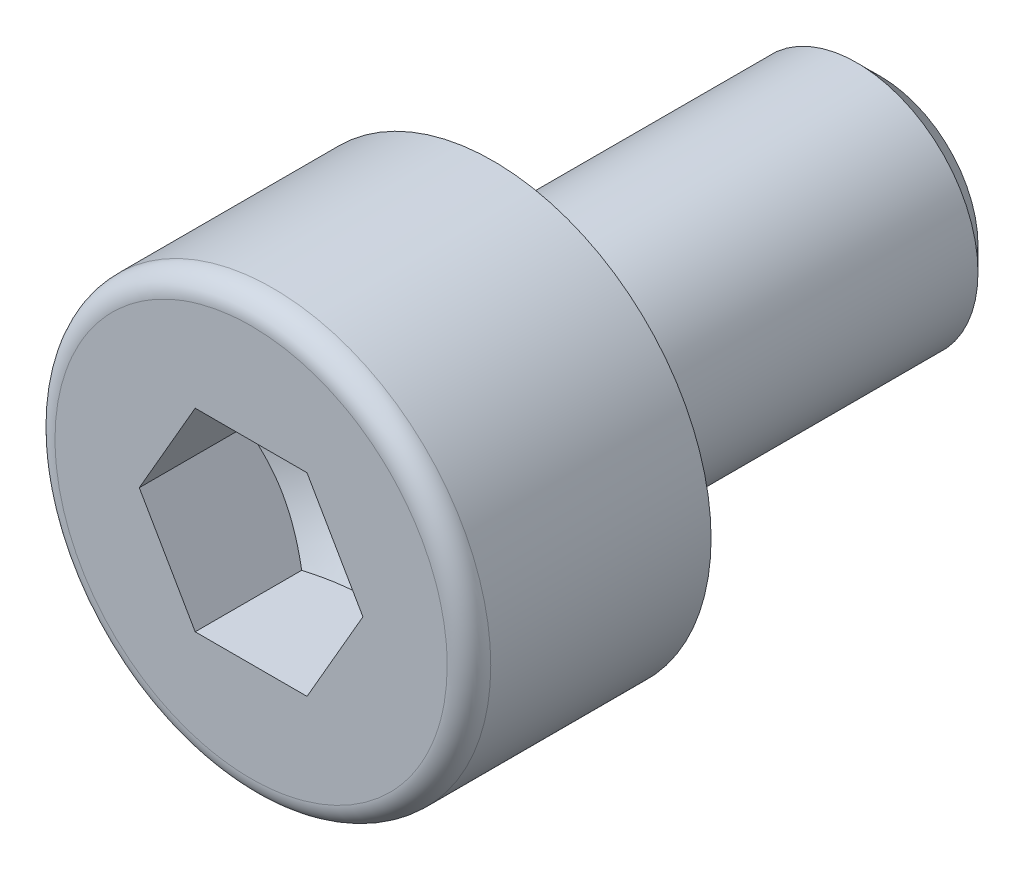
ISO-10303-21;
HEADER;
FILE_DESCRIPTION(('STEP AP214'),'2;1');
FILE_NAME('part.step','',(''),(''),'','','');
FILE_SCHEMA(('AUTOMOTIVE_DESIGN { 1 0 10303 214 1 1 1 1 }'));
ENDSEC;
DATA;
#1=APPLICATION_CONTEXT('core data for automotive mechanical design processes');
#2=APPLICATION_PROTOCOL_DEFINITION('international standard','automotive_design',2000,#1);
#3=PRODUCT_CONTEXT('',#1,'mechanical');
#4=PRODUCT('Part','Part','',(#3));
#5=PRODUCT_RELATED_PRODUCT_CATEGORY('part','',(#4));
#6=PRODUCT_DEFINITION_FORMATION('','',#4);
#7=PRODUCT_DEFINITION_CONTEXT('part definition',#1,'design');
#8=PRODUCT_DEFINITION('design','',#6,#7);
#9=PRODUCT_DEFINITION_SHAPE('','',#8);
#10=(LENGTH_UNIT() NAMED_UNIT(*) SI_UNIT(.MILLI.,.METRE.));
#11=(NAMED_UNIT(*) PLANE_ANGLE_UNIT() SI_UNIT($,.RADIAN.));
#12=(NAMED_UNIT(*) SI_UNIT($,.STERADIAN.) SOLID_ANGLE_UNIT());
#13=UNCERTAINTY_MEASURE_WITH_UNIT(LENGTH_MEASURE(1.E-05),#10,'distance_accuracy_value','');
#14=(GEOMETRIC_REPRESENTATION_CONTEXT(3) GLOBAL_UNCERTAINTY_ASSIGNED_CONTEXT((#13)) GLOBAL_UNIT_ASSIGNED_CONTEXT((#10,
#11,#12)) REPRESENTATION_CONTEXT('',''));
#15=CARTESIAN_POINT('',(0.,0.,0.));
#16=DIRECTION('',(0.,0.,1.));
#17=DIRECTION('',(1.,0.,0.));
#18=AXIS2_PLACEMENT_3D('',#15,#16,#17);
#19=CARTESIAN_POINT('',(0.,0.503218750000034,-4.00000000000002));
#20=DIRECTION('',(0.,0.,-1.));
#21=DIRECTION('',(-1.,0.,0.));
#22=AXIS2_PLACEMENT_3D('',#19,#20,#21);
#23=PLANE('',#22);
#24=CARTESIAN_POINT('',(0.,0.,-3.99999999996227));
#25=DIRECTION('',(0.,0.,1.));
#26=DIRECTION('',(0.,-1.,0.));
#27=AXIS2_PLACEMENT_3D('',#24,#25,#26);
#28=CIRCLE('',#27,1.00643749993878);
#29=CARTESIAN_POINT('',(0.,-1.00643749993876,-3.99999999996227));
#30=VERTEX_POINT('',#29);
#31=EDGE_CURVE('E22',#30,#30,#28,.T.);
#32=ORIENTED_EDGE('',*,*,#31,.F.);
#33=EDGE_LOOP('',(#32));
#34=FACE_BOUND('',#33,.T.);
#35=ADVANCED_FACE('F17',(#34),#23,.T.);
#36=CARTESIAN_POINT('',(0.,0.,-3.75643749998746));
#37=DIRECTION('',(0.,0.,1.));
#38=DIRECTION('',(0.,-1.,0.));
#39=AXIS2_PLACEMENT_3D('',#36,#37,#38);
#40=CONICAL_SURFACE('',#39,1.24999999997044,0.78539816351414);
#41=CARTESIAN_POINT('',(0.,0.,-3.7564375));
#42=DIRECTION('',(0.,0.,1.));
#43=DIRECTION('',(1.,0.,0.));
#44=AXIS2_PLACEMENT_3D('',#41,#42,#43);
#45=CIRCLE('',#44,1.25);
#46=CARTESIAN_POINT('',(1.24999999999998,0.,-3.7564375));
#47=VERTEX_POINT('',#46);
#48=EDGE_CURVE('E93',#47,#47,#45,.T.);
#49=ORIENTED_EDGE('',*,*,#48,.F.);
#50=EDGE_LOOP('',(#49));
#51=FACE_BOUND('',#50,.T.);
#52=ORIENTED_EDGE('',*,*,#31,.T.);
#53=EDGE_LOOP('',(#52));
#54=FACE_BOUND('',#53,.T.);
#55=ADVANCED_FACE('F83',(#51,#54),#40,.T.);
#56=CARTESIAN_POINT('',(0.,0.,1.40399999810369));
#57=DIRECTION('',(0.,0.,1.));
#58=DIRECTION('',(1.,0.,0.));
#59=AXIS2_PLACEMENT_3D('',#56,#57,#58);
#60=CONICAL_SURFACE('',#59,1.1616281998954,1.04719755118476);
#61=CARTESIAN_POINT('',(0.,0.,0.733333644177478));
#62=VERTEX_POINT('',#61);
#63=VERTEX_LOOP('',#62);
#64=FACE_BOUND('',#63,.T.);
#65=CARTESIAN_POINT('',(0.577350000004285,-0.999999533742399,1.4000000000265));
#66=CARTESIAN_POINT('',(0.602721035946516,-0.956055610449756,1.38534777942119));
#67=CARTESIAN_POINT('',(0.62831107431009,-0.911732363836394,1.37202235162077));
#68=CARTESIAN_POINT('',(0.679934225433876,-0.822318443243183,1.34876321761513));
#69=CARTESIAN_POINT('',(0.705968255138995,-0.777226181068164,1.33883773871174));
#70=CARTESIAN_POINT('',(0.757713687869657,-0.687600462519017,1.32338801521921));
#71=CARTESIAN_POINT('',(0.783417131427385,-0.643080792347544,1.31776093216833));
#72=CARTESIAN_POINT('',(0.834944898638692,-0.553832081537,1.31104462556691));
#73=CARTESIAN_POINT('',(0.860769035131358,-0.509103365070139,1.30994983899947));
#74=CARTESIAN_POINT('',(0.909018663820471,-0.425532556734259,1.31223318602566));
#75=CARTESIAN_POINT('',(0.931451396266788,-0.386677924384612,1.31505068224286));
#76=CARTESIAN_POINT('',(0.97617071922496,-0.309221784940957,1.32397868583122));
#77=CARTESIAN_POINT('',(0.998457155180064,-0.270620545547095,1.330092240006));
#78=CARTESIAN_POINT('',(1.04326860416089,-0.193004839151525,1.34537494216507));
#79=CARTESIAN_POINT('',(1.06578794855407,-0.154000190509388,1.35460884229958));
#80=CARTESIAN_POINT('',(1.11049085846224,-0.0765724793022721,1.37556589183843));
#81=CARTESIAN_POINT('',(1.13267499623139,-0.0381484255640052,1.38728412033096));
#82=CARTESIAN_POINT('',(1.15469999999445,-9.5062846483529E-12,1.40000000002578));
#83=B_SPLINE_CURVE_WITH_KNOTS('',3,(#65,#66,#67,#68,#69,#70,#71,#72,#73,#74,#75,#76,#77,#78,#79,
#80,#81,#82),.UNSPECIFIED.,.F.,.F.,(4,2,2,2,2,2,2,2,4),(0.,0.158507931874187,0.317396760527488,
0.47235358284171,0.627120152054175,0.761853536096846,0.896711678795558,1.03456032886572,
1.17213844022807),.UNSPECIFIED.);
#84=CARTESIAN_POINT('',(0.577349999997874,-0.999999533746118,1.4000000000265));
#85=VERTEX_POINT('',#84);
#86=CARTESIAN_POINT('',(1.15470000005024,0.,1.40000000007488));
#87=VERTEX_POINT('',#86);
#88=EDGE_CURVE('E75',#85,#87,#83,.T.);
#89=ORIENTED_EDGE('',*,*,#88,.T.);
#90=CARTESIAN_POINT('',(1.15469999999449,9.57567358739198E-12,1.40000000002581));
#91=CARTESIAN_POINT('',(1.12932896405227,0.0439439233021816,1.38534777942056));
#92=CARTESIAN_POINT('',(1.10373892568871,0.0882671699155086,1.3720223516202));
#93=CARTESIAN_POINT('',(1.05211577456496,0.17768109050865,1.34876321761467));
#94=CARTESIAN_POINT('',(1.02608174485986,0.222773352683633,1.33883773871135));
#95=CARTESIAN_POINT('',(0.974336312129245,0.312399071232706,1.32338801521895));
#96=CARTESIAN_POINT('',(0.948632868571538,0.35691874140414,1.31776093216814));
#97=CARTESIAN_POINT('',(0.89710510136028,0.446167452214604,1.31104462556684));
#98=CARTESIAN_POINT('',(0.871280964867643,0.490896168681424,1.30994983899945));
#99=CARTESIAN_POINT('',(0.823031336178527,0.574466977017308,1.31223318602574));
#100=CARTESIAN_POINT('',(0.800598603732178,0.613321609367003,1.315050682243));
#101=CARTESIAN_POINT('',(0.755879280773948,0.690777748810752,1.32397868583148));
#102=CARTESIAN_POINT('',(0.733592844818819,0.729378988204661,1.33009224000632));
#103=CARTESIAN_POINT('',(0.688781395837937,0.806994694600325,1.34537494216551));
#104=CARTESIAN_POINT('',(0.666262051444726,0.845999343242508,1.35460884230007));
#105=CARTESIAN_POINT('',(0.621559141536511,0.923427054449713,1.37556589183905));
#106=CARTESIAN_POINT('',(0.599375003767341,0.961851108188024,1.38728412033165));
#107=CARTESIAN_POINT('',(0.577350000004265,0.999999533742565,1.40000000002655));
#108=B_SPLINE_CURVE_WITH_KNOTS('',3,(#90,#91,#92,#93,#94,#95,#96,#97,#98,#99,#100,#101,#102,
#103,#104,#105,#106,#107),.UNSPECIFIED.,.F.,.F.,(4,2,2,2,2,2,2,2,4),(0.,0.15850793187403,
0.317396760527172,0.472353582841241,0.627120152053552,0.761853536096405,0.8967116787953,
1.03456032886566,1.17213844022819),.UNSPECIFIED.);
#109=CARTESIAN_POINT('',(0.577349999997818,0.999999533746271,1.40000000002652));
#110=VERTEX_POINT('',#109);
#111=EDGE_CURVE('E87',#87,#110,#108,.T.);
#112=ORIENTED_EDGE('',*,*,#111,.T.);
#113=CARTESIAN_POINT('',(0.577349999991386,0.999999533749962,1.40000000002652));
#114=CARTESIAN_POINT('',(0.526607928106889,0.999999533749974,1.38534777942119));
#115=CARTESIAN_POINT('',(0.475427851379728,0.999999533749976,1.37202235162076));
#116=CARTESIAN_POINT('',(0.372181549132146,0.999999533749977,1.34876321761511));
#117=CARTESIAN_POINT('',(0.320113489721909,0.999999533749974,1.33883773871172));
#118=CARTESIAN_POINT('',(0.216622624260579,0.999999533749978,1.3233880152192));
#119=CARTESIAN_POINT('',(0.165215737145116,0.999999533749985,1.31776093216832));
#120=CARTESIAN_POINT('',(0.0621602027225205,0.999999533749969,1.31104462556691));
#121=CARTESIAN_POINT('',(0.0105119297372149,0.999999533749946,1.30994983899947));
#122=CARTESIAN_POINT('',(-0.0859873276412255,0.99999953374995,1.31223318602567));
#123=CARTESIAN_POINT('',(-0.130852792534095,0.99999953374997,1.31505068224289));
#124=CARTESIAN_POINT('',(-0.220291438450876,0.999999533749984,1.32397868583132));
#125=CARTESIAN_POINT('',(-0.264864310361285,0.999999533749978,1.33009224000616));
#126=CARTESIAN_POINT('',(-0.354487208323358,0.999999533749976,1.34537494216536));
#127=CARTESIAN_POINT('',(-0.399525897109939,0.99999953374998,1.35460884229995));
#128=CARTESIAN_POINT('',(-0.488931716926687,0.999999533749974,1.37556589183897));
#129=CARTESIAN_POINT('',(-0.533299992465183,0.999999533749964,1.3872841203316));
#130=CARTESIAN_POINT('',(-0.57734999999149,0.999999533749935,1.40000000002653));
#131=B_SPLINE_CURVE_WITH_KNOTS('',3,(#113,#114,#115,#116,#117,#118,#119,#120,#121,#122,#123,
#124,#125,#126,#127,#128,#129,#130),.UNSPECIFIED.,.F.,.F.,(4,2,2,2,2,2,2,2,4),(0.,
0.158507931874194,0.317396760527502,0.472353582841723,0.627120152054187,0.761853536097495,
0.896711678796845,1.03456032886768,1.17213844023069),.UNSPECIFIED.);
#132=CARTESIAN_POINT('',(-0.577349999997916,0.999999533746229,1.40000000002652));
#133=VERTEX_POINT('',#132);
#134=EDGE_CURVE('E109',#110,#133,#131,.T.);
#135=ORIENTED_EDGE('',*,*,#134,.T.);
#136=CARTESIAN_POINT('',(-0.577350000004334,0.99999953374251,1.40000000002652));
#137=CARTESIAN_POINT('',(-0.602721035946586,0.956055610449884,1.38534777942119));
#138=CARTESIAN_POINT('',(-0.628311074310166,0.911732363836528,1.37202235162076));
#139=CARTESIAN_POINT('',(-0.679934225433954,0.822318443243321,1.34876321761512));
#140=CARTESIAN_POINT('',(-0.70596825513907,0.777226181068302,1.33883773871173));
#141=CARTESIAN_POINT('',(-0.757713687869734,0.687600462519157,1.32338801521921));
#142=CARTESIAN_POINT('',(-0.783417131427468,0.643080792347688,1.31776093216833));
#143=CARTESIAN_POINT('',(-0.83494489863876,0.553832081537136,1.31104462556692));
#144=CARTESIAN_POINT('',(-0.860769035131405,0.509103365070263,1.3099498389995));
#145=CARTESIAN_POINT('',(-0.909018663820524,0.425532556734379,1.31223318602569));
#146=CARTESIAN_POINT('',(-0.931451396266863,0.386677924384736,1.31505068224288));
#147=CARTESIAN_POINT('',(-0.976170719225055,0.309221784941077,1.32397868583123));
#148=CARTESIAN_POINT('',(-0.998457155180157,0.270620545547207,1.33009224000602));
#149=CARTESIAN_POINT('',(-1.04326860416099,0.193004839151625,1.34537494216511));
#150=CARTESIAN_POINT('',(-1.06578794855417,0.154000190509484,1.35460884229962));
#151=CARTESIAN_POINT('',(-1.11049085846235,0.0765724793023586,1.37556589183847));
#152=CARTESIAN_POINT('',(-1.1326749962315,0.0381484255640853,1.387284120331));
#153=CARTESIAN_POINT('',(-1.15469999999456,9.57567358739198E-12,1.40000000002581));
#154=B_SPLINE_CURVE_WITH_KNOTS('',3,(#136,#137,#138,#139,#140,#141,#142,#143,#144,#145,#146,
#147,#148,#149,#150,#151,#152,#153),.UNSPECIFIED.,.F.,.F.,(4,2,2,2,2,2,2,2,4),(0.,
0.158507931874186,0.317396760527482,0.472353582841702,0.627120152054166,0.761853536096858,
0.896711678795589,1.03456032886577,1.17213844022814),.UNSPECIFIED.);
#155=CARTESIAN_POINT('',(-1.15469999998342,-4.71844785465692E-12,1.40000000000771));
#156=VERTEX_POINT('',#155);
#157=EDGE_CURVE('E167',#133,#156,#154,.T.);
#158=ORIENTED_EDGE('',*,*,#157,.T.);
#159=CARTESIAN_POINT('',(-1.1546999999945,-9.5062846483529E-12,1.40000000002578));
#160=CARTESIAN_POINT('',(-1.12932896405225,-0.0439439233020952,1.38534777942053));
#161=CARTESIAN_POINT('',(-1.10373892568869,-0.0882671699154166,1.37202235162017));
#162=CARTESIAN_POINT('',(-1.05211577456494,-0.177681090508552,1.34876321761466));
#163=CARTESIAN_POINT('',(-1.02608174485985,-0.222773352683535,1.33883773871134));
#164=CARTESIAN_POINT('',(-0.974336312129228,-0.3123990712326,1.32338801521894));
#165=CARTESIAN_POINT('',(-0.948632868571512,-0.356918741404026,1.31776093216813));
#166=CARTESIAN_POINT('',(-0.897105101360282,-0.446167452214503,1.31104462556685));
#167=CARTESIAN_POINT('',(-0.871280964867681,-0.490896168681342,1.30994983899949));
#168=CARTESIAN_POINT('',(-0.823031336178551,-0.574466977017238,1.31223318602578));
#169=CARTESIAN_POINT('',(-0.800598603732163,-0.613321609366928,1.31505068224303));
#170=CARTESIAN_POINT('',(-0.755879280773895,-0.69077774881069,1.3239786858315));
#171=CARTESIAN_POINT('',(-0.733592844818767,-0.729378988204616,1.33009224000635));
#172=CARTESIAN_POINT('',(-0.688781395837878,-0.806994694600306,1.34537494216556));
#173=CARTESIAN_POINT('',(-0.666262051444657,-0.845999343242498,1.35460884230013));
#174=CARTESIAN_POINT('',(-0.621559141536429,-0.923427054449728,1.37556589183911));
#175=CARTESIAN_POINT('',(-0.599375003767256,-0.961851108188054,1.38728412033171));
#176=CARTESIAN_POINT('',(-0.577350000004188,-0.999999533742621,1.4000000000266));
#177=B_SPLINE_CURVE_WITH_KNOTS('',3,(#159,#160,#161,#162,#163,#164,#165,#166,#167,#168,#169,
#170,#171,#172,#173,#174,#175,#176),.UNSPECIFIED.,.F.,.F.,(4,2,2,2,2,2,2,2,4),(0.,
0.158507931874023,0.317396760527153,0.472353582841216,0.627120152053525,0.761853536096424,
0.896711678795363,1.03456032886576,1.17213844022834),.UNSPECIFIED.);
#178=CARTESIAN_POINT('',(-0.577349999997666,-0.999999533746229,1.40000000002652));
#179=VERTEX_POINT('',#178);
#180=EDGE_CURVE('E137',#156,#179,#177,.T.);
#181=ORIENTED_EDGE('',*,*,#180,.T.);
#182=CARTESIAN_POINT('',(-0.577349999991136,-0.999999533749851,1.40000000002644));
#183=CARTESIAN_POINT('',(-0.526607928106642,-0.999999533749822,1.38534777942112));
#184=CARTESIAN_POINT('',(-0.475427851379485,-0.999999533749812,1.37202235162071));
#185=CARTESIAN_POINT('',(-0.372181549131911,-0.999999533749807,1.34876321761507));
#186=CARTESIAN_POINT('',(-0.320113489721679,-0.999999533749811,1.33883773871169));
#187=CARTESIAN_POINT('',(-0.216622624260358,-0.999999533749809,1.32338801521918));
#188=CARTESIAN_POINT('',(-0.165215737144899,-0.999999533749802,1.31776093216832));
#189=CARTESIAN_POINT('',(-0.0621602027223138,-0.999999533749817,1.31104462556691));
#190=CARTESIAN_POINT('',(-0.0105119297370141,-0.999999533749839,1.30994983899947));
#191=CARTESIAN_POINT('',(0.0859873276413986,-0.999999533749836,1.31223318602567));
#192=CARTESIAN_POINT('',(0.130852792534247,-0.999999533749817,1.31505068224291));
#193=CARTESIAN_POINT('',(0.220291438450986,-0.999999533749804,1.32397868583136));
#194=CARTESIAN_POINT('',(0.264864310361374,-0.999999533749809,1.33009224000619));
#195=CARTESIAN_POINT('',(0.354487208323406,-0.999999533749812,1.34537494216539));
#196=CARTESIAN_POINT('',(0.399525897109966,-0.999999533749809,1.35460884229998));
#197=CARTESIAN_POINT('',(0.488931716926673,-0.999999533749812,1.37556589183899));
#198=CARTESIAN_POINT('',(0.53329999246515,-0.999999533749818,1.38728412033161));
#199=CARTESIAN_POINT('',(0.577349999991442,-0.999999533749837,1.4000000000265));
#200=B_SPLINE_CURVE_WITH_KNOTS('',3,(#182,#183,#184,#185,#186,#187,#188,#189,#190,#191,#192,
#193,#194,#195,#196,#197,#198,#199),.UNSPECIFIED.,.F.,.F.,(4,2,2,2,2,2,2,2,4),(0.,
0.158507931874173,0.317396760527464,0.47235358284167,0.627120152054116,0.761853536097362,
0.896711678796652,1.03456032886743,1.17213844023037),.UNSPECIFIED.);
#201=EDGE_CURVE('E90',#179,#85,#200,.T.);
#202=ORIENTED_EDGE('',*,*,#201,.T.);
#203=EDGE_LOOP('',(#89,#112,#135,#158,#181,#202));
#204=FACE_BOUND('',#203,.T.);
#205=ADVANCED_FACE('F79',(#64,#204),#60,.F.);
#206=CARTESIAN_POINT('',(0.,0.,-0.149999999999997));
#207=DIRECTION('',(0.,0.,1.));
#208=DIRECTION('',(1.,0.,0.));
#209=AXIS2_PLACEMENT_3D('',#206,#207,#208);
#210=CYLINDRICAL_SURFACE('',#209,1.25);
#211=CARTESIAN_POINT('',(0.,0.,-0.125));
#212=DIRECTION('',(0.,0.,-1.));
#213=DIRECTION('',(-1.,0.,0.));
#214=AXIS2_PLACEMENT_3D('',#211,#212,#213);
#215=CIRCLE('',#214,1.25);
#216=CARTESIAN_POINT('',(-1.25000000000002,0.,-0.125000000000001));
#217=VERTEX_POINT('',#216);
#218=EDGE_CURVE('E103',#217,#217,#215,.T.);
#219=ORIENTED_EDGE('',*,*,#218,.T.);
#220=EDGE_LOOP('',(#219));
#221=FACE_BOUND('',#220,.T.);
#222=ORIENTED_EDGE('',*,*,#48,.T.);
#223=EDGE_LOOP('',(#222));
#224=FACE_BOUND('',#223,.T.);
#225=ADVANCED_FACE('F82',(#221,#224),#210,.T.);
#226=CARTESIAN_POINT('',(0.577349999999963,-0.999999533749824,2.5));
#227=DIRECTION('',(0.866025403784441,-0.500000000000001,0.));
#228=DIRECTION('',(0.500000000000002,0.866025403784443,0.));
#229=AXIS2_PLACEMENT_3D('',#226,#227,#228);
#230=PLANE('',#229);
#231=DIRECTION('',(-0.500000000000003,-0.866025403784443,0.));
#232=VECTOR('',#231,1.);
#233=CARTESIAN_POINT('',(1.15469999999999,0.,2.49999999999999));
#234=LINE('',#233,#232);
#235=CARTESIAN_POINT('',(1.15469999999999,0.,2.49999999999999));
#236=VERTEX_POINT('',#235);
#237=CARTESIAN_POINT('',(0.577350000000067,-0.99999953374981,2.5));
#238=VERTEX_POINT('',#237);
#239=EDGE_CURVE('E99',#236,#238,#234,.T.);
#240=ORIENTED_EDGE('',*,*,#239,.F.);
#241=DIRECTION('',(0.,0.,1.));
#242=VECTOR('',#241,1.);
#243=CARTESIAN_POINT('',(1.15469999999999,0.,2.49999999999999));
#244=LINE('',#243,#242);
#245=EDGE_CURVE('E96',#236,#87,#244,.F.);
#246=ORIENTED_EDGE('',*,*,#245,.T.);
#247=ORIENTED_EDGE('',*,*,#88,.F.);
#248=DIRECTION('',(0.,0.,-1.));
#249=VECTOR('',#248,1.);
#250=CARTESIAN_POINT('',(0.577350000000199,-0.999999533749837,2.5));
#251=LINE('',#250,#249);
#252=EDGE_CURVE('E92',#85,#238,#251,.F.);
#253=ORIENTED_EDGE('',*,*,#252,.T.);
#254=EDGE_LOOP('',(#240,#246,#247,#253));
#255=FACE_BOUND('',#254,.T.);
#256=ADVANCED_FACE('F97',(#255),#230,.F.);
#257=CARTESIAN_POINT('',(-0.577350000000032,-0.99999953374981,2.50000000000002));
#258=DIRECTION('',(0.,-1.,0.));
#259=DIRECTION('',(0.,0.,-1.));
#260=AXIS2_PLACEMENT_3D('',#257,#258,#259);
#261=PLANE('',#260);
#262=DIRECTION('',(0.,0.,1.));
#263=VECTOR('',#262,1.);
#264=CARTESIAN_POINT('',(-0.577349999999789,-0.999999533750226,2.50000000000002));
#265=LINE('',#264,#263);
#266=CARTESIAN_POINT('',(-0.577349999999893,-0.999999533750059,2.50000000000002));
#267=VERTEX_POINT('',#266);
#268=EDGE_CURVE('E172',#179,#267,#265,.T.);
#269=ORIENTED_EDGE('',*,*,#268,.T.);
#270=DIRECTION('',(1.,0.,0.));
#271=VECTOR('',#270,1.);
#272=CARTESIAN_POINT('',(0.,-0.999999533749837,2.5));
#273=LINE('',#272,#271);
#274=EDGE_CURVE('E235',#238,#267,#273,.F.);
#275=ORIENTED_EDGE('',*,*,#274,.F.);
#276=ORIENTED_EDGE('',*,*,#252,.F.);
#277=ORIENTED_EDGE('',*,*,#201,.F.);
#278=EDGE_LOOP('',(#269,#275,#276,#277));
#279=FACE_BOUND('',#278,.T.);
#280=ADVANCED_FACE('F151',(#279),#261,.F.);
#281=CARTESIAN_POINT('',(-1.15469999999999,0.,2.5));
#282=DIRECTION('',(-0.866025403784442,-0.500000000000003,0.));
#283=DIRECTION('',(0.5,-0.866025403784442,0.));
#284=AXIS2_PLACEMENT_3D('',#281,#282,#283);
#285=PLANE('',#284);
#286=DIRECTION('',(-0.500000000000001,0.866025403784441,0.));
#287=VECTOR('',#286,1.);
#288=CARTESIAN_POINT('',(-0.577350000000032,-0.99999953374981,2.50000000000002));
#289=LINE('',#288,#287);
#290=CARTESIAN_POINT('',(-1.15470000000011,0.,2.5));
#291=VERTEX_POINT('',#290);
#292=EDGE_CURVE('E250',#267,#291,#289,.T.);
#293=ORIENTED_EDGE('',*,*,#292,.F.);
#294=ORIENTED_EDGE('',*,*,#268,.F.);
#295=ORIENTED_EDGE('',*,*,#180,.F.);
#296=DIRECTION('',(0.,0.,1.));
#297=VECTOR('',#296,1.);
#298=CARTESIAN_POINT('',(-1.15470000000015,-1.17961196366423E-13,2.5));
#299=LINE('',#298,#297);
#300=EDGE_CURVE('E171',#156,#291,#299,.T.);
#301=ORIENTED_EDGE('',*,*,#300,.T.);
#302=EDGE_LOOP('',(#293,#294,#295,#301));
#303=FACE_BOUND('',#302,.T.);
#304=ADVANCED_FACE('F154',(#303),#285,.F.);
#305=CARTESIAN_POINT('',(-0.577350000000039,0.999999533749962,2.50000000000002));
#306=DIRECTION('',(-0.866025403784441,0.500000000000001,0.));
#307=DIRECTION('',(-0.500000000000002,-0.866025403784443,0.));
#308=AXIS2_PLACEMENT_3D('',#305,#306,#307);
#309=PLANE('',#308);
#310=DIRECTION('',(0.500000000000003,0.866025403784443,0.));
#311=VECTOR('',#310,1.);
#312=CARTESIAN_POINT('',(-1.15469999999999,0.,2.5));
#313=LINE('',#312,#311);
#314=CARTESIAN_POINT('',(-0.577350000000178,0.999999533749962,2.50000000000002));
#315=VERTEX_POINT('',#314);
#316=EDGE_CURVE('E245',#291,#315,#313,.T.);
#317=ORIENTED_EDGE('',*,*,#316,.F.);
#318=ORIENTED_EDGE('',*,*,#300,.F.);
#319=ORIENTED_EDGE('',*,*,#157,.F.);
#320=DIRECTION('',(0.,0.,1.));
#321=VECTOR('',#320,1.);
#322=CARTESIAN_POINT('',(-0.577350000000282,0.99999953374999,2.50000000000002));
#323=LINE('',#322,#321);
#324=EDGE_CURVE('E112',#133,#315,#323,.T.);
#325=ORIENTED_EDGE('',*,*,#324,.T.);
#326=EDGE_LOOP('',(#317,#318,#319,#325));
#327=FACE_BOUND('',#326,.T.);
#328=ADVANCED_FACE('F160',(#327),#309,.F.);
#329=CARTESIAN_POINT('',(0.577349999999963,0.999999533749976,2.5));
#330=DIRECTION('',(0.,1.,0.));
#331=DIRECTION('',(-1.,0.,0.));
#332=AXIS2_PLACEMENT_3D('',#329,#330,#331);
#333=PLANE('',#332);
#334=DIRECTION('',(0.,0.,1.));
#335=VECTOR('',#334,1.);
#336=CARTESIAN_POINT('',(0.577349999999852,0.999999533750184,2.5));
#337=LINE('',#336,#335);
#338=CARTESIAN_POINT('',(0.577349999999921,0.999999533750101,2.5));
#339=VERTEX_POINT('',#338);
#340=EDGE_CURVE('E104',#110,#339,#337,.T.);
#341=ORIENTED_EDGE('',*,*,#340,.T.);
#342=DIRECTION('',(1.,0.,0.));
#343=VECTOR('',#342,1.);
#344=CARTESIAN_POINT('',(0.,0.999999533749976,2.49999999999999));
#345=LINE('',#344,#343);
#346=EDGE_CURVE('E240',#315,#339,#345,.T.);
#347=ORIENTED_EDGE('',*,*,#346,.F.);
#348=ORIENTED_EDGE('',*,*,#324,.F.);
#349=ORIENTED_EDGE('',*,*,#134,.F.);
#350=EDGE_LOOP('',(#341,#347,#348,#349));
#351=FACE_BOUND('',#350,.T.);
#352=ADVANCED_FACE('F164',(#351),#333,.F.);
#353=CARTESIAN_POINT('',(1.15469999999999,0.,2.49999999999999));
#354=DIRECTION('',(0.866025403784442,0.500000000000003,0.));
#355=DIRECTION('',(-0.5,0.866025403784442,0.));
#356=AXIS2_PLACEMENT_3D('',#353,#354,#355);
#357=PLANE('',#356);
#358=DIRECTION('',(0.5,-0.866025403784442,0.));
#359=VECTOR('',#358,1.);
#360=CARTESIAN_POINT('',(0.577349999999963,0.999999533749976,2.5));
#361=LINE('',#360,#359);
#362=EDGE_CURVE('E238',#339,#236,#361,.T.);
#363=ORIENTED_EDGE('',*,*,#362,.F.);
#364=ORIENTED_EDGE('',*,*,#340,.F.);
#365=ORIENTED_EDGE('',*,*,#111,.F.);
#366=ORIENTED_EDGE('',*,*,#245,.F.);
#367=EDGE_LOOP('',(#363,#364,#365,#366));
#368=FACE_BOUND('',#367,.T.);
#369=ADVANCED_FACE('F107',(#368),#357,.F.);
#370=CARTESIAN_POINT('',(0.,0.,-0.125));
#371=DIRECTION('',(0.,0.,-1.));
#372=DIRECTION('',(-1.,0.,0.));
#373=AXIS2_PLACEMENT_3D('',#370,#371,#372);
#374=TOROIDAL_SURFACE('',#373,1.375,0.125);
#375=ORIENTED_EDGE('',*,*,#218,.F.);
#376=EDGE_LOOP('',(#375));
#377=FACE_BOUND('',#376,.T.);
#378=CARTESIAN_POINT('',(1.37499999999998,0.,0.));
#379=CARTESIAN_POINT('',(1.37480478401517,0.262281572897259,0.));
#380=CARTESIAN_POINT('',(1.27845891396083,0.506130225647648,0.));
#381=CARTESIAN_POINT('',(1.17417698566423,0.77006481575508,0.));
#382=CARTESIAN_POINT('',(0.972271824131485,0.972271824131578,0.));
#383=CARTESIAN_POINT('',(0.771808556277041,1.17303478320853,0.));
#384=CARTESIAN_POINT('',(0.506130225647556,1.27845891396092,0.));
#385=CARTESIAN_POINT('',(0.26333141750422,1.37480419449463,0.));
#386=CARTESIAN_POINT('',(0.,1.37500000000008,0.));
#387=B_SPLINE_CURVE_WITH_KNOTS('',2,(#378,#379,#380,#381,#382,#383,#384,#385,#386),
.UNSPECIFIED.,.F.,.F.,(3,2,2,2,3),(0.,0.25,0.5,0.75,1.),.UNSPECIFIED.);
#388=CARTESIAN_POINT('',(1.37499999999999,0.,0.));
#389=VERTEX_POINT('',#388);
#390=CARTESIAN_POINT('',(0.,1.37500000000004,0.));
#391=VERTEX_POINT('',#390);
#392=EDGE_CURVE('E222',#389,#391,#387,.T.);
#393=ORIENTED_EDGE('',*,*,#392,.F.);
#394=CARTESIAN_POINT('',(-1.37500000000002,0.,0.));
#395=CARTESIAN_POINT('',(-1.37480478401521,-0.262281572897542,0.));
#396=CARTESIAN_POINT('',(-1.27845891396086,-0.506130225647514,0.));
#397=CARTESIAN_POINT('',(-1.17417698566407,-0.770064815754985,0.));
#398=CARTESIAN_POINT('',(-0.972271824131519,-0.972271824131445,0.));
#399=CARTESIAN_POINT('',(-0.771808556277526,-1.1730347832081,0.));
#400=CARTESIAN_POINT('',(-0.506130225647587,-1.27845891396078,0.));
#401=CARTESIAN_POINT('',(-0.263332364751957,-1.37480381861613,0.));
#402=CARTESIAN_POINT('',(0.,-1.37499999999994,0.));
#403=CARTESIAN_POINT('',(0.261294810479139,-1.37519466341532,0.));
#404=CARTESIAN_POINT('',(0.506130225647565,-1.27845891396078,0.));
#405=CARTESIAN_POINT('',(0.770064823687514,-1.17417697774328,0.));
#406=CARTESIAN_POINT('',(0.972271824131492,-0.972271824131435,0.));
#407=CARTESIAN_POINT('',(1.17303478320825,-0.771808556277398,0.));
#408=CARTESIAN_POINT('',(1.27845891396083,-0.506130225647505,0.));
#409=CARTESIAN_POINT('',(1.37480419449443,-0.263331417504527,0.));
#410=CARTESIAN_POINT('',(1.37499999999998,0.,0.));
#411=B_SPLINE_CURVE_WITH_KNOTS('',2,(#394,#395,#396,#397,#398,#399,#400,#401,#402,#403,#404,
#405,#406,#407,#408,#409,#410),.UNSPECIFIED.,.F.,.F.,(3,2,2,2,2,2,2,2,3),(0.,0.125,0.25,0.375,
0.5,0.625,0.75,0.875,1.),.UNSPECIFIED.);
#412=CARTESIAN_POINT('',(-1.37500000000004,0.,0.));
#413=VERTEX_POINT('',#412);
#414=EDGE_CURVE('E203',#413,#389,#411,.T.);
#415=ORIENTED_EDGE('',*,*,#414,.F.);
#416=CARTESIAN_POINT('',(0.,1.37500000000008,0.));
#417=CARTESIAN_POINT('',(-0.262281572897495,1.37480478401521,0.));
#418=CARTESIAN_POINT('',(-0.506130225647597,1.27845891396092,0.));
#419=CARTESIAN_POINT('',(-0.77006481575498,1.17417698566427,0.));
#420=CARTESIAN_POINT('',(-0.972271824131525,0.972271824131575,0.));
#421=CARTESIAN_POINT('',(-1.17303478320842,0.77180855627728,0.));
#422=CARTESIAN_POINT('',(-1.27845891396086,0.506130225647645,0.));
#423=CARTESIAN_POINT('',(-1.37480419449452,0.263331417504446,0.));
#424=CARTESIAN_POINT('',(-1.37500000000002,0.,0.));
#425=B_SPLINE_CURVE_WITH_KNOTS('',2,(#416,#417,#418,#419,#420,#421,#422,#423,#424),
.UNSPECIFIED.,.F.,.F.,(3,2,2,2,3),(0.,0.25,0.5,0.75,1.),.UNSPECIFIED.);
#426=EDGE_CURVE('E198',#391,#413,#425,.T.);
#427=ORIENTED_EDGE('',*,*,#426,.F.);
#428=EDGE_LOOP('',(#393,#415,#427));
#429=FACE_BOUND('',#428,.T.);
#430=ADVANCED_FACE('F272',(#377,#429),#374,.F.);
#431=CARTESIAN_POINT('',(0.,1.01250000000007,2.49999999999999));
#432=DIRECTION('',(0.,0.,1.));
#433=DIRECTION('',(1.,0.,0.));
#434=AXIS2_PLACEMENT_3D('',#431,#432,#433);
#435=PLANE('',#434);
#436=ORIENTED_EDGE('',*,*,#346,.T.);
#437=ORIENTED_EDGE('',*,*,#362,.T.);
#438=ORIENTED_EDGE('',*,*,#239,.T.);
#439=ORIENTED_EDGE('',*,*,#274,.T.);
#440=ORIENTED_EDGE('',*,*,#292,.T.);
#441=ORIENTED_EDGE('',*,*,#316,.T.);
#442=EDGE_LOOP('',(#436,#437,#438,#439,#440,#441));
#443=FACE_BOUND('',#442,.T.);
#444=CARTESIAN_POINT('',(2.02499999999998,0.,2.49999999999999));
#445=CARTESIAN_POINT('',(2.02499441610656,-0.0216587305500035,2.50000000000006));
#446=CARTESIAN_POINT('',(2.02464131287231,-0.0433172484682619,2.49999999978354));
#447=CARTESIAN_POINT('',(2.02325453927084,-0.0861923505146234,2.49999999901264));
#448=CARTESIAN_POINT('',(2.02223418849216,-0.107409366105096,2.49999999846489));
#449=CARTESIAN_POINT('',(2.01955359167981,-0.149382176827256,2.49999999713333));
#450=CARTESIAN_POINT('',(2.01790638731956,-0.170138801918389,2.49999999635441));
#451=CARTESIAN_POINT('',(2.01401285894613,-0.211172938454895,2.49999999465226));
#452=CARTESIAN_POINT('',(2.01177927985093,-0.231451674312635,2.49999999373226));
#453=CARTESIAN_POINT('',(2.00431800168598,-0.290923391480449,2.49999999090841));
#454=CARTESIAN_POINT('',(1.998247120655,-0.330014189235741,2.49999998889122));
#455=CARTESIAN_POINT('',(1.98413535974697,-0.406120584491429,2.49999998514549));
#456=CARTESIAN_POINT('',(1.9761890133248,-0.443153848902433,2.49999998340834));
#457=CARTESIAN_POINT('',(1.95863230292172,-0.515087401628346,2.49999998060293));
#458=CARTESIAN_POINT('',(1.94911128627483,-0.550009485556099,2.49999997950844));
#459=CARTESIAN_POINT('',(1.9286983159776,-0.617687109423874,2.49999997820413));
#460=CARTESIAN_POINT('',(1.91789040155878,-0.65046802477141,2.49999997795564));
#461=CARTESIAN_POINT('',(1.89518156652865,-0.713855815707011,2.49999997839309));
#462=CARTESIAN_POINT('',(1.88335934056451,-0.744490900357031,2.49999997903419));
#463=CARTESIAN_POINT('',(1.85888353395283,-0.80360066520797,2.49999998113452));
#464=CARTESIAN_POINT('',(1.84630331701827,-0.832105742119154,2.49999998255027));
#465=CARTESIAN_POINT('',(1.82055605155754,-0.886987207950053,2.49999998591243));
#466=CARTESIAN_POINT('',(1.8074570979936,-0.913395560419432,2.49999998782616));
#467=CARTESIAN_POINT('',(1.78089932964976,-0.964130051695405,2.49999999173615));
#468=CARTESIAN_POINT('',(1.76750344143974,-0.988489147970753,2.49999999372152));
#469=CARTESIAN_POINT('',(1.74056108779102,-1.03518342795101,2.49999999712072));
#470=CARTESIAN_POINT('',(1.72707251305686,-1.05755202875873,2.49999999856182));
#471=CARTESIAN_POINT('',(1.70013659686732,-1.10033244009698,2.50000000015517));
#472=CARTESIAN_POINT('',(1.68674226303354,-1.12077764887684,2.50000000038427));
#473=CARTESIAN_POINT('',(1.66016933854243,-1.15978535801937,2.4999999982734));
#474=CARTESIAN_POINT('',(1.64703905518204,-1.17838075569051,2.4999999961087));
#475=CARTESIAN_POINT('',(1.62115265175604,-1.21376518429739,2.49999998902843));
#476=CARTESIAN_POINT('',(1.60844028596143,-1.23058633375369,2.49999998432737));
#477=CARTESIAN_POINT('',(1.57262597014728,-1.27648010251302,2.49999996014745));
#478=CARTESIAN_POINT('',(1.54898054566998,-1.30513311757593,2.4999999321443));
#479=CARTESIAN_POINT('',(1.51260117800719,-1.34682927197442,2.49999987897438));
#480=CARTESIAN_POINT('',(1.5004482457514,-1.36038524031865,2.49999985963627));
#481=CARTESIAN_POINT('',(1.47728429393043,-1.38557171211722,2.49999977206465));
#482=CARTESIAN_POINT('',(1.46631191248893,-1.39723756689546,2.49999970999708));
#483=CARTESIAN_POINT('',(1.4521717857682,-1.41186407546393,2.49999968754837));
#484=CARTESIAN_POINT('',(1.44915019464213,-1.41496648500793,2.49999968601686));
#485=CARTESIAN_POINT('',(1.43896125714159,-1.4253586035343,2.49999968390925));
#486=CARTESIAN_POINT('',(1.43174687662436,-1.43260225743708,2.49999968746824));
#487=CARTESIAN_POINT('',(1.41070253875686,-1.45341396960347,2.49999969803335));
#488=CARTESIAN_POINT('',(1.39673114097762,-1.46683938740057,2.49999970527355));
#489=CARTESIAN_POINT('',(1.36254640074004,-1.49875569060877,2.49999972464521));
#490=CARTESIAN_POINT('',(1.34214300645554,-1.51704321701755,2.49999973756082));
#491=CARTESIAN_POINT('',(1.2945302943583,-1.55800610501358,2.49999976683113));
#492=CARTESIAN_POINT('',(1.26707685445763,-1.58039910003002,2.49999978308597));
#493=CARTESIAN_POINT('',(1.22266784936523,-1.61472228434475,2.49999980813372));
#494=CARTESIAN_POINT('',(1.20608431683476,-1.62713758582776,2.4999998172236));
#495=CARTESIAN_POINT('',(1.17092043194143,-1.65263060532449,2.49999983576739));
#496=CARTESIAN_POINT('',(1.15230214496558,-1.66565615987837,2.4999998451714));
#497=CARTESIAN_POINT('',(1.11600585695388,-1.69015007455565,2.49999986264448));
#498=CARTESIAN_POINT('',(1.09835776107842,-1.70166282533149,2.4999998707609));
#499=CARTESIAN_POINT('',(1.06146483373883,-1.72491734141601,2.49999988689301));
#500=CARTESIAN_POINT('',(1.04219461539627,-1.73661886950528,2.49999989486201));
#501=CARTESIAN_POINT('',(1.00200287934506,-1.76011519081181,2.49999991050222));
#502=CARTESIAN_POINT('',(0.981055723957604,-1.77186614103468,2.49999991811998));
#503=CARTESIAN_POINT('',(0.937459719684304,-1.79531304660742,2.49999993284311));
#504=CARTESIAN_POINT('',(0.91478528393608,-1.80696145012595,2.49999993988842));
#505=CARTESIAN_POINT('',(0.867690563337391,-1.83004202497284,2.49999995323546));
#506=CARTESIAN_POINT('',(0.843245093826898,-1.84142282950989,2.49999995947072));
#507=CARTESIAN_POINT('',(0.792572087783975,-1.86379393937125,2.49999997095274));
#508=CARTESIAN_POINT('',(0.766320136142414,-1.87472897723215,2.49999997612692));
#509=CARTESIAN_POINT('',(0.712008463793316,-1.89602129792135,2.4999999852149));
#510=CARTESIAN_POINT('',(0.683925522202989,-1.90631934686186,2.49999998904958));
#511=CARTESIAN_POINT('',(0.625936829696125,-1.92613766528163,2.49999999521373));
#512=CARTESIAN_POINT('',(0.596009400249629,-1.93559469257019,2.49999999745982));
#513=CARTESIAN_POINT('',(0.54660663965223,-1.94995301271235,2.49999999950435));
#514=CARTESIAN_POINT('',(0.527250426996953,-1.95526807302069,2.4999999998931));
#515=CARTESIAN_POINT('',(0.487894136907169,-1.96544955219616,2.50000000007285));
#516=CARTESIAN_POINT('',(0.467890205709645,-1.9703011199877,2.49999999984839));
#517=CARTESIAN_POINT('',(0.427246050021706,-1.9795058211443,2.49999999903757));
#518=CARTESIAN_POINT('',(0.4066023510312,-1.98384360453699,2.49999999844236));
#519=CARTESIAN_POINT('',(0.364688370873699,-1.99197026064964,2.49999999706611));
#520=CARTESIAN_POINT('',(0.343415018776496,-1.99574330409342,2.49999999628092));
#521=CARTESIAN_POINT('',(0.300254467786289,-2.00268879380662,2.49999999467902));
#522=CARTESIAN_POINT('',(0.278364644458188,-2.00584493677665,2.499999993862));
#523=CARTESIAN_POINT('',(0.233986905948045,-2.01150404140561,2.49999999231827));
#524=CARTESIAN_POINT('',(0.21149685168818,-2.013990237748,2.49999999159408));
#525=CARTESIAN_POINT('',(0.165937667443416,-2.01825606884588,2.49999999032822));
#526=CARTESIAN_POINT('',(0.142866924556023,-2.02001848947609,2.49999998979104));
#527=CARTESIAN_POINT('',(0.0961688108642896,-2.0227827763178,2.49999998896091));
#528=CARTESIAN_POINT('',(0.0725403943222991,-2.02376699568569,2.49999998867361));
#529=CARTESIAN_POINT('',(0.0247529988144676,-2.02492045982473,2.49999998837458));
#530=CARTESIAN_POINT('',(0.000593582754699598,-2.02507164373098,2.49999998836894));
#531=CARTESIAN_POINT('',(-0.0482259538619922,-2.0245043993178,2.49999998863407));
#532=CARTESIAN_POINT('',(-0.0728858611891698,-2.02376751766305,2.49999998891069));
#533=CARTESIAN_POINT('',(-0.122672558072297,-2.02136951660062,2.49999998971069));
#534=CARTESIAN_POINT('',(-0.147798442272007,-2.01968957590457,2.49999999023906));
#535=CARTESIAN_POINT('',(-0.1984791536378,-2.01535109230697,2.4999999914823));
#536=CARTESIAN_POINT('',(-0.224032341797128,-2.01267338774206,2.49999999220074));
#537=CARTESIAN_POINT('',(-0.275525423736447,-2.00628555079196,2.49999999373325));
#538=CARTESIAN_POINT('',(-0.301462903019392,-2.00255594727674,2.49999999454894));
#539=CARTESIAN_POINT('',(-0.35367801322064,-1.99401129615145,2.49999999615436));
#540=CARTESIAN_POINT('',(-0.379952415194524,-1.98917650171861,2.49999999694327));
#541=CARTESIAN_POINT('',(-0.432789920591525,-1.97836966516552,2.49999999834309));
#542=CARTESIAN_POINT('',(-0.45934893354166,-1.97237763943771,2.49999999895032));
#543=CARTESIAN_POINT('',(-0.512700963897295,-1.95920574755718,2.49999999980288));
#544=CARTESIAN_POINT('',(-0.539489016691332,-1.95200569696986,2.50000000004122));
#545=CARTESIAN_POINT('',(-0.57915478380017,-1.94046608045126,2.49999999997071));
#546=CARTESIAN_POINT('',(-0.592154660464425,-1.93654191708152,2.49999999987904));
#547=CARTESIAN_POINT('',(-0.618072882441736,-1.92843275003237,2.49999999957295));
#548=CARTESIAN_POINT('',(-0.630991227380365,-1.92424774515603,2.49999999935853));
#549=CARTESIAN_POINT('',(-0.66961593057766,-1.91130405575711,2.49999999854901));
#550=CARTESIAN_POINT('',(-0.695193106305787,-1.90215636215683,2.49999999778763));
#551=CARTESIAN_POINT('',(-0.745958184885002,-1.88283937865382,2.499999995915));
#552=CARTESIAN_POINT('',(-0.771146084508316,-1.87267008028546,2.49999999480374));
#553=CARTESIAN_POINT('',(-0.821092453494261,-1.85132622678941,2.49999999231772));
#554=CARTESIAN_POINT('',(-0.845850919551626,-1.84015166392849,2.49999999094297));
#555=CARTESIAN_POINT('',(-0.898985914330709,-1.81487038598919,2.49999998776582));
#556=CARTESIAN_POINT('',(-0.927277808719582,-1.80058536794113,2.49999998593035));
#557=CARTESIAN_POINT('',(-0.983159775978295,-1.77070314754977,2.49999998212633));
#558=CARTESIAN_POINT('',(-1.01074984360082,-1.75510593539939,2.49999998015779));
#559=CARTESIAN_POINT('',(-1.06516773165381,-1.72263352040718,2.49999997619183));
#560=CARTESIAN_POINT('',(-1.09199554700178,-1.70575830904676,2.49999997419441));
#561=CARTESIAN_POINT('',(-1.14482964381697,-1.6707671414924,2.49999997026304));
#562=CARTESIAN_POINT('',(-1.17083592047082,-1.6526511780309,2.49999996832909));
#563=CARTESIAN_POINT('',(-1.22196961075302,-1.61521842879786,2.49999996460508));
#564=CARTESIAN_POINT('',(-1.24709701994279,-1.59590163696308,2.49999996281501));
#565=CARTESIAN_POINT('',(-1.29641754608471,-1.55610982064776,2.49999995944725));
#566=CARTESIAN_POINT('',(-1.32061065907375,-1.53563479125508,2.49999995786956));
#567=CARTESIAN_POINT('',(-1.36800923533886,-1.49357164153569,2.49999995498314));
#568=CARTESIAN_POINT('',(-1.39121469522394,-1.47198351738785,2.49999995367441));
#569=CARTESIAN_POINT('',(-1.43658678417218,-1.42774177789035,2.49999995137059));
#570=CARTESIAN_POINT('',(-1.45875341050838,-1.40508815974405,2.4999999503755));
#571=CARTESIAN_POINT('',(-1.50199894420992,-1.35876538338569,2.49999994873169));
#572=CARTESIAN_POINT('',(-1.52307784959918,-1.33509622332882,2.49999994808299));
#573=CARTESIAN_POINT('',(-1.56410145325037,-1.28679455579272,2.49999994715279));
#574=CARTESIAN_POINT('',(-1.58404615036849,-1.26216204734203,2.49999994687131));
#575=CARTESIAN_POINT('',(-1.62275735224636,-1.21198800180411,2.49999994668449));
#576=CARTESIAN_POINT('',(-1.6415238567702,-1.18644646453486,2.49999994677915));
#577=CARTESIAN_POINT('',(-1.67783728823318,-1.13451068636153,2.49999994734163));
#578=CARTESIAN_POINT('',(-1.6953842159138,-1.10811644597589,2.49999994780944));
#579=CARTESIAN_POINT('',(-1.72921979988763,-1.05453346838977,2.49999994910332));
#580=CARTESIAN_POINT('',(-1.74550845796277,-1.02734473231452,2.49999994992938));
#581=CARTESIAN_POINT('',(-1.77679158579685,-0.972232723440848,2.49999995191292));
#582=CARTESIAN_POINT('',(-1.79178605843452,-0.944309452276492,2.49999995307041));
#583=CARTESIAN_POINT('',(-1.82044775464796,-0.887789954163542,2.49999995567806));
#584=CARTESIAN_POINT('',(-1.83411498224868,-0.859193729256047,2.49999995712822));
#585=CARTESIAN_POINT('',(-1.86009205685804,-0.801391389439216,2.49999996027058));
#586=CARTESIAN_POINT('',(-1.87240190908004,-0.77218527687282,2.49999996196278));
#587=CARTESIAN_POINT('',(-1.89563709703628,-0.713227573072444,2.49999996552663));
#588=CARTESIAN_POINT('',(-1.90656243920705,-0.683475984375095,2.49999996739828));
#589=CARTESIAN_POINT('',(-1.92700452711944,-0.623492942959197,2.49999997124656));
#590=CARTESIAN_POINT('',(-1.93652128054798,-0.593261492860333,2.49999997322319));
#591=CARTESIAN_POINT('',(-1.95412521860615,-0.532385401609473,2.49999997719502));
#592=CARTESIAN_POINT('',(-1.96221241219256,-0.501740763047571,2.49999997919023));
#593=CARTESIAN_POINT('',(-1.9769394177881,-0.440105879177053,2.49999998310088));
#594=CARTESIAN_POINT('',(-1.98357924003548,-0.409115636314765,2.49999998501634));
#595=CARTESIAN_POINT('',(-1.99539686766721,-0.346857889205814,2.49999998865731));
#596=CARTESIAN_POINT('',(-2.00057468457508,-0.31559038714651,2.49999999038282));
#597=CARTESIAN_POINT('',(-2.00945695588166,-0.252847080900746,2.49999999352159));
#598=CARTESIAN_POINT('',(-2.01316142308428,-0.221371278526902,2.49999999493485));
#599=CARTESIAN_POINT('',(-2.01908866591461,-0.158280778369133,2.49999999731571));
#600=CARTESIAN_POINT('',(-2.02131145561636,-0.126666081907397,2.49999999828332));
#601=CARTESIAN_POINT('',(-2.02427116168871,-0.0633675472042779,2.49999999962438));
#602=CARTESIAN_POINT('',(-2.02500809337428,-0.0316837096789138,2.49999999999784));
#603=CARTESIAN_POINT('',(-2.02500000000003,0.,2.49999999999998));
#604=B_SPLINE_CURVE_WITH_KNOTS('',3,(#444,#445,#446,#447,#448,#449,#450,#451,#452,#453,#454,
#455,#456,#457,#458,#459,#460,#461,#462,#463,#464,#465,#466,#467,#468,#469,#470,#471,#472,#473,
#474,#475,#476,#477,#478,#479,#480,#481,#482,#483,#484,#485,#486,#487,#488,#489,#490,#491,#492,
#493,#494,#495,#496,#497,#498,#499,#500,#501,#502,#503,#504,#505,#506,#507,#508,#509,#510,#511,
#512,#513,#514,#515,#516,#517,#518,#519,#520,#521,#522,#523,#524,#525,#526,#527,#528,#529,#530,
#531,#532,#533,#534,#535,#536,#537,#538,#539,#540,#541,#542,#543,#544,#545,#546,#547,#548,#549,
#550,#551,#552,#553,#554,#555,#556,#557,#558,#559,#560,#561,#562,#563,#564,#565,#566,#567,#568,
#569,#570,#571,#572,#573,#574,#575,#576,#577,#578,#579,#580,#581,#582,#583,#584,#585,#586,#587,
#588,#589,#590,#591,#592,#593,#594,#595,#596,#597,#598,#599,#600,#601,#602,#603),.UNSPECIFIED.,
.F.,.F.,(4,2,2,2,2,2,2,2,2,2,2,2,2,2,2,2,2,2,2,2,2,2,2,2,2,2,2,2,2,2,2,2,2,2,2,2,2,2,2,2,2,2,2,
2,2,2,2,2,2,2,2,2,2,2,2,2,2,2,2,2,2,2,2,2,2,2,2,2,2,2,2,2,2,2,2,2,2,2,2,4),(0.,
0.064973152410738,0.128687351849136,0.191142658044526,0.252339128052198,0.37094307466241,
0.484513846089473,0.593051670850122,0.696556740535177,0.795029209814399,0.888469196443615,
0.976876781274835,1.06025200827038,1.13859488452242,1.21190538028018,1.28018342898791,
1.34342892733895,1.45481131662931,1.5094250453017,1.55746470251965,1.57045672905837,
1.60112574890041,1.65924647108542,1.74142340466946,1.84765266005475,1.90979260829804,
1.97794595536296,2.04114992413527,2.10877157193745,2.18081064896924,2.25726688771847,
2.33814000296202,2.42342969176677,2.51313563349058,2.60725748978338,2.66746768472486,
2.72920943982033,2.79248279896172,2.85728781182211,2.92362453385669,2.9914930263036,
3.06089335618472,3.13182559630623,3.20428982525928,3.27828612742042,3.35381459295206,
3.43087531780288,3.50946840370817,3.58959395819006,3.67125209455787,3.75444293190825,
3.79517831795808,3.83591389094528,3.91738144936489,3.99884968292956,4.08031854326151,
4.17536395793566,4.27041008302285,4.36545684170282,4.46050415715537,4.55555195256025,
4.65060015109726,4.74564867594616,4.84069745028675,4.93574639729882,5.03079544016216,
5.12584450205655,5.2208935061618,5.3159423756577,5.41099103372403,5.50603940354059,
5.60108740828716,5.69613497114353,5.79118201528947,5.88622846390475,5.98127424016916,
6.07631926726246,6.17136346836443,6.26640676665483,6.36144908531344),.UNSPECIFIED.);
#605=CARTESIAN_POINT('',(2.02499999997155,-1.08051304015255E-07,2.50000000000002));
#606=VERTEX_POINT('',#605);
#607=CARTESIAN_POINT('',(-2.02500000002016,-8.49983000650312E-08,2.50000000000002));
#608=VERTEX_POINT('',#607);
#609=EDGE_CURVE('E204',#606,#608,#604,.T.);
#610=ORIENTED_EDGE('',*,*,#609,.F.);
#611=CARTESIAN_POINT('',(0.,2.02500000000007,2.49999999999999));
#612=CARTESIAN_POINT('',(0.0364049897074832,2.02500525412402,2.49999997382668));
#613=CARTESIAN_POINT('',(0.0728026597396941,2.02401982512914,2.49999998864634));
#614=CARTESIAN_POINT('',(0.145493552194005,2.02011569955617,2.50000001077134));
#615=CARTESIAN_POINT('',(0.181786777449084,2.01719705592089,2.50000001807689));
#616=CARTESIAN_POINT('',(0.261418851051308,2.00870251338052,2.49999992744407));
#617=CARTESIAN_POINT('',(0.304715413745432,2.00271197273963,2.4999998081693));
#618=CARTESIAN_POINT('',(0.358288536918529,1.99340665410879,2.49999977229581));
#619=CARTESIAN_POINT('',(0.368815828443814,1.99148628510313,2.49999977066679));
#620=CARTESIAN_POINT('',(0.409316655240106,1.98375554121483,2.49999977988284));
#621=CARTESIAN_POINT('',(0.439174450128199,1.97733128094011,2.4999998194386));
#622=CARTESIAN_POINT('',(0.517110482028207,1.95870960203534,2.49999990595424));
#623=CARTESIAN_POINT('',(0.564931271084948,1.94541131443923,2.4999999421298));
#624=CARTESIAN_POINT('',(0.636177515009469,1.92273919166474,2.49999998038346));
#625=CARTESIAN_POINT('',(0.660022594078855,1.91465646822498,2.49999999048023));
#626=CARTESIAN_POINT('',(0.705741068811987,1.89820848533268,2.50000000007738));
#627=CARTESIAN_POINT('',(0.72763575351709,1.88990249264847,2.50000000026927));
#628=CARTESIAN_POINT('',(0.785623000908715,1.86676163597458,2.4999999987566));
#629=CARTESIAN_POINT('',(0.821453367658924,1.85126467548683,2.49999999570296));
#630=CARTESIAN_POINT('',(0.892170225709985,1.81825024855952,2.49999999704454));
#631=CARTESIAN_POINT('',(0.927056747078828,1.80073284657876,2.50000000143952));
#632=CARTESIAN_POINT('',(0.978590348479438,1.77298719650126,2.49999999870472));
#633=CARTESIAN_POINT('',(0.995636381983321,1.76349319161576,2.49999999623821));
#634=CARTESIAN_POINT('',(1.02945140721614,1.74402248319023,2.49999998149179));
#635=CARTESIAN_POINT('',(1.04622039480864,1.73404577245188,2.49999996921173));
#636=CARTESIAN_POINT('',(1.08279076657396,1.71157287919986,2.49999992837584));
#637=CARTESIAN_POINT('',(1.10252781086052,1.69897189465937,2.49999989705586));
#638=CARTESIAN_POINT('',(1.14156469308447,1.67310823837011,2.49999977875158));
#639=CARTESIAN_POINT('',(1.16086451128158,1.65984553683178,2.49999969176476));
#640=CARTESIAN_POINT('',(1.20556163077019,1.62794052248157,2.49999949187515));
#641=CARTESIAN_POINT('',(1.2307625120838,1.60902234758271,2.4999993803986));
#642=CARTESIAN_POINT('',(1.286383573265,1.56510244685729,2.49999939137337));
#643=CARTESIAN_POINT('',(1.31653707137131,1.53976059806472,2.49999957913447));
#644=CARTESIAN_POINT('',(1.36342928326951,1.49772695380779,2.49999987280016));
#645=CARTESIAN_POINT('',(1.38070741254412,1.48163193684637,2.4999999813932));
#646=CARTESIAN_POINT('',(1.40166413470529,1.46152434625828,2.50000000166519));
#647=CARTESIAN_POINT('',(1.40557243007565,1.45774881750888,2.50000000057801));
#648=CARTESIAN_POINT('',(1.41854078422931,1.44514173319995,2.49999999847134));
#649=CARTESIAN_POINT('',(1.4275482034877,1.43625573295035,2.49999999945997));
#650=CARTESIAN_POINT('',(1.44998838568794,1.41370182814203,2.50000000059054));
#651=CARTESIAN_POINT('',(1.46331319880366,1.39992623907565,2.500000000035));
#652=CARTESIAN_POINT('',(1.4940341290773,1.3672651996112,2.49999999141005));
#653=CARTESIAN_POINT('',(1.51127527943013,1.34823388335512,2.49999998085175));
#654=CARTESIAN_POINT('',(1.54930714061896,1.30462335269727,2.49999993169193));
#655=CARTESIAN_POINT('',(1.56988904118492,1.27986126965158,2.49999988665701));
#656=CARTESIAN_POINT('',(1.60192717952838,1.23938754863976,2.49999979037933));
#657=CARTESIAN_POINT('',(1.61376746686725,1.22397817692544,2.49999974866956));
#658=CARTESIAN_POINT('',(1.63699393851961,1.19282043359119,2.49999966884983));
#659=CARTESIAN_POINT('',(1.64838011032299,1.17707205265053,2.49999963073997));
#660=CARTESIAN_POINT('',(1.6818442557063,1.12933985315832,2.49999952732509));
#661=CARTESIAN_POINT('',(1.70322985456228,1.09686645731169,2.49999947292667));
#662=CARTESIAN_POINT('',(1.7440749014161,1.03073281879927,2.49999941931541));
#663=CARTESIAN_POINT('',(1.76353434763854,0.99707257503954,2.49999942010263));
#664=CARTESIAN_POINT('',(1.80046084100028,0.928677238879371,2.49999947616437));
#665=CARTESIAN_POINT('',(1.81792795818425,0.893942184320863,2.49999953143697));
#666=CARTESIAN_POINT('',(1.85081633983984,0.823520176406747,2.49999967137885));
#667=CARTESIAN_POINT('',(1.86623775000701,0.787833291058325,2.49999975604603));
#668=CARTESIAN_POINT('',(1.89495738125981,0.715617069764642,2.49999990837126));
#669=CARTESIAN_POINT('',(1.90825583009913,0.67908782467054,2.49999997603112));
#670=CARTESIAN_POINT('',(1.92501976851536,0.628685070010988,2.50000000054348));
#671=CARTESIAN_POINT('',(1.92938205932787,0.615103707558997,2.5000000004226));
#672=CARTESIAN_POINT('',(1.94043946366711,0.579434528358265,2.49999999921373));
#673=CARTESIAN_POINT('',(1.94691026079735,0.55727660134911,2.49999999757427));
#674=CARTESIAN_POINT('',(1.96142030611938,0.504249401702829,2.49999999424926));
#675=CARTESIAN_POINT('',(1.96911480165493,0.473284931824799,2.49999999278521));
#676=CARTESIAN_POINT('',(1.98027926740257,0.423368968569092,2.49999999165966));
#677=CARTESIAN_POINT('',(1.98421493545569,0.404520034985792,2.49999999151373));
#678=CARTESIAN_POINT('',(1.99196814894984,0.364553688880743,2.49999999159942));
#679=CARTESIAN_POINT('',(1.99572061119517,0.343423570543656,2.49999999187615));
#680=CARTESIAN_POINT('',(2.00290416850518,0.298879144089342,2.49999999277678));
#681=CARTESIAN_POINT('',(2.00626267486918,0.275453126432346,2.4999999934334));
#682=CARTESIAN_POINT('',(2.01243230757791,0.226310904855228,2.49999999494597));
#683=CARTESIAN_POINT('',(2.01516331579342,0.200584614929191,2.49999999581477));
#684=CARTESIAN_POINT('',(2.01982936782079,0.146850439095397,2.49999999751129));
#685=CARTESIAN_POINT('',(2.02167676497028,0.118834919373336,2.49999999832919));
#686=CARTESIAN_POINT('',(2.02430594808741,0.0605492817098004,2.49999999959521));
#687=CARTESIAN_POINT('',(2.02499267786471,0.030274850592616,2.50000000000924));
#688=CARTESIAN_POINT('',(2.02499999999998,0.,2.49999999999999));
#689=B_SPLINE_CURVE_WITH_KNOTS('',3,(#611,#612,#613,#614,#615,#616,#617,#618,#619,#620,#621,
#622,#623,#624,#625,#626,#627,#628,#629,#630,#631,#632,#633,#634,#635,#636,#637,#638,#639,#640,
#641,#642,#643,#644,#645,#646,#647,#648,#649,#650,#651,#652,#653,#654,#655,#656,#657,#658,#659,
#660,#661,#662,#663,#664,#665,#666,#667,#668,#669,#670,#671,#672,#673,#674,#675,#676,#677,#678,
#679,#680,#681,#682,#683,#684,#685,#686,#687,#688),.UNSPECIFIED.,.F.,.F.,(4,2,2,2,2,2,2,2,2,2,2,
2,2,2,2,2,2,2,2,2,2,2,2,2,2,2,2,2,2,2,2,2,2,2,2,2,2,2,4),(0.,0.109187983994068,
0.218372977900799,0.349390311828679,0.381492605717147,0.473085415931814,0.621837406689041,
0.697356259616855,0.767594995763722,0.884643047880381,1.00168736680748,1.06021559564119,
1.11874469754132,1.18898057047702,1.2592196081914,1.35371920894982,1.4717982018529,
1.54262423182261,1.55892653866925,1.5968832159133,1.65437199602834,1.7313938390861,
1.8279506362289,1.88624214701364,1.94453526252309,2.06111186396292,2.17768857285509,
2.29426118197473,2.41082548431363,2.52737727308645,2.57016976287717,2.63940713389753,
2.73508613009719,2.79284587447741,2.85721687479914,2.92819912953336,3.00579266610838,
3.08999754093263,3.18081383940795),.UNSPECIFIED.);
#690=CARTESIAN_POINT('',(0.,2.02500000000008,2.49999999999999));
#691=VERTEX_POINT('',#690);
#692=EDGE_CURVE('E37',#691,#606,#689,.T.);
#693=ORIENTED_EDGE('',*,*,#692,.F.);
#694=CARTESIAN_POINT('',(-2.02500000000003,0.,2.49999999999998));
#695=CARTESIAN_POINT('',(-2.02500522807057,0.0364049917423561,2.49999997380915));
#696=CARTESIAN_POINT('',(-2.02401977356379,0.0728026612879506,2.49999998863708));
#697=CARTESIAN_POINT('',(-2.02011561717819,0.145493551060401,2.50000001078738));
#698=CARTESIAN_POINT('',(-2.017196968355,0.181786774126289,2.50000001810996));
#699=CARTESIAN_POINT('',(-2.00870245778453,0.261418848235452,2.49999992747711));
#700=CARTESIAN_POINT('',(-2.00271196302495,0.30471541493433,2.49999980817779));
#701=CARTESIAN_POINT('',(-1.99340682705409,0.358287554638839,2.49999977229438));
#702=CARTESIAN_POINT('',(-1.99148664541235,0.368813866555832,2.4999997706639));
#703=CARTESIAN_POINT('',(-1.98375620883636,0.409313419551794,2.49999977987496));
#704=CARTESIAN_POINT('',(-1.97733206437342,0.439170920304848,2.49999981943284));
#705=CARTESIAN_POINT('',(-1.95871043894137,0.517107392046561,2.4999999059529));
#706=CARTESIAN_POINT('',(-1.94541202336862,0.564928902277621,2.49999994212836));
#707=CARTESIAN_POINT('',(-1.9227395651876,0.636176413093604,2.49999998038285));
#708=CARTESIAN_POINT('',(-1.91465666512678,0.660022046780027,2.49999999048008));
#709=CARTESIAN_POINT('',(-1.89820848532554,0.705741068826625,2.50000000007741));
#710=CARTESIAN_POINT('',(-1.8899024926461,0.727635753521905,2.50000000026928));
#711=CARTESIAN_POINT('',(-1.86676163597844,0.785623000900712,2.49999999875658));
#712=CARTESIAN_POINT('',(-1.85126467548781,0.821453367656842,2.49999999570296));
#713=CARTESIAN_POINT('',(-1.81825024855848,0.892170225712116,2.49999999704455));
#714=CARTESIAN_POINT('',(-1.80073284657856,0.927056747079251,2.50000000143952));
#715=CARTESIAN_POINT('',(-1.77298719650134,0.978590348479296,2.49999999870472));
#716=CARTESIAN_POINT('',(-1.76349319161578,0.995636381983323,2.49999999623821));
#717=CARTESIAN_POINT('',(-1.7440224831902,1.02945140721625,2.49999998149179));
#718=CARTESIAN_POINT('',(-1.73404577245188,1.04622039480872,2.49999996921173));
#719=CARTESIAN_POINT('',(-1.71157287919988,1.08279076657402,2.49999992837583));
#720=CARTESIAN_POINT('',(-1.69897189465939,1.1025278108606,2.49999989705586));
#721=CARTESIAN_POINT('',(-1.67310823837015,1.14156469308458,2.49999977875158));
#722=CARTESIAN_POINT('',(-1.65984553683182,1.16086451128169,2.49999969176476));
#723=CARTESIAN_POINT('',(-1.62794052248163,1.20556163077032,2.49999949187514));
#724=CARTESIAN_POINT('',(-1.60902234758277,1.23076251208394,2.4999993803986));
#725=CARTESIAN_POINT('',(-1.56510244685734,1.28638357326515,2.49999939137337));
#726=CARTESIAN_POINT('',(-1.53976059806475,1.31653707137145,2.49999957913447));
#727=CARTESIAN_POINT('',(-1.49772695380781,1.36342928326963,2.49999987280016));
#728=CARTESIAN_POINT('',(-1.48163193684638,1.38070741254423,2.4999999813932));
#729=CARTESIAN_POINT('',(-1.46152434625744,1.40166413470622,2.50000000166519));
#730=CARTESIAN_POINT('',(-1.45774881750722,1.40557243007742,2.50000000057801));
#731=CARTESIAN_POINT('',(-1.44514173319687,1.41854078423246,2.49999999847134));
#732=CARTESIAN_POINT('',(-1.43625573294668,1.42754820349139,2.49999999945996));
#733=CARTESIAN_POINT('',(-1.41370182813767,1.44998838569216,2.50000000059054));
#734=CARTESIAN_POINT('',(-1.3999262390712,1.46331319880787,2.500000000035));
#735=CARTESIAN_POINT('',(-1.36726519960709,1.49403412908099,2.49999999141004));
#736=CARTESIAN_POINT('',(-1.34823388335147,1.51127527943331,2.49999998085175));
#737=CARTESIAN_POINT('',(-1.30462335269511,1.54930714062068,2.49999993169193));
#738=CARTESIAN_POINT('',(-1.27986126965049,1.56988904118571,2.49999988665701));
#739=CARTESIAN_POINT('',(-1.23938754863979,1.60192717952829,2.49999979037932));
#740=CARTESIAN_POINT('',(-1.22397817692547,1.61376746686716,2.49999974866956));
#741=CARTESIAN_POINT('',(-1.19282043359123,1.63699393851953,2.49999966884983));
#742=CARTESIAN_POINT('',(-1.17707205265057,1.6483801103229,2.49999963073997));
#743=CARTESIAN_POINT('',(-1.12933985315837,1.68184425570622,2.49999952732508));
#744=CARTESIAN_POINT('',(-1.09686645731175,1.7032298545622,2.49999947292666));
#745=CARTESIAN_POINT('',(-1.03073281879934,1.74407490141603,2.49999941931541));
#746=CARTESIAN_POINT('',(-0.997072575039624,1.76353434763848,2.49999942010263));
#747=CARTESIAN_POINT('',(-0.928677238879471,1.80046084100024,2.49999947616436));
#748=CARTESIAN_POINT('',(-0.893942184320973,1.81792795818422,2.49999953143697));
#749=CARTESIAN_POINT('',(-0.823520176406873,1.85081633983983,2.49999967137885));
#750=CARTESIAN_POINT('',(-0.787833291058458,1.86623775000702,2.49999975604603));
#751=CARTESIAN_POINT('',(-0.715617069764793,1.89495738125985,2.49999990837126));
#752=CARTESIAN_POINT('',(-0.679087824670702,1.9082558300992,2.49999997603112));
#753=CARTESIAN_POINT('',(-0.62868507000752,1.92501976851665,2.50000000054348));
#754=CARTESIAN_POINT('',(-0.615103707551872,1.92938205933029,2.5000000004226));
#755=CARTESIAN_POINT('',(-0.579434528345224,1.94043946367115,2.49999999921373));
#756=CARTESIAN_POINT('',(-0.557276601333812,1.94691026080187,2.49999999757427));
#757=CARTESIAN_POINT('',(-0.504249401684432,1.96142030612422,2.49999999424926));
#758=CARTESIAN_POINT('',(-0.473284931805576,1.96911480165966,2.49999999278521));
#759=CARTESIAN_POINT('',(-0.423368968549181,1.98027926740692,2.49999999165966));
#760=CARTESIAN_POINT('',(-0.404520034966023,1.98421493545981,2.49999999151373));
#761=CARTESIAN_POINT('',(-0.364553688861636,1.99196814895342,2.49999999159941));
#762=CARTESIAN_POINT('',(-0.343423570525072,1.99572061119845,2.49999999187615));
#763=CARTESIAN_POINT('',(-0.298879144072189,2.00290416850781,2.49999999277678));
#764=CARTESIAN_POINT('',(-0.275453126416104,2.00626267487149,2.4999999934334));
#765=CARTESIAN_POINT('',(-0.2263109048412,2.01243230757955,2.49999999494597));
#766=CARTESIAN_POINT('',(-0.20058461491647,2.01516331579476,2.49999999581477));
#767=CARTESIAN_POINT('',(-0.14685043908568,2.01982936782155,2.49999999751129));
#768=CARTESIAN_POINT('',(-0.11883491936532,2.02167676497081,2.49999999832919));
#769=CARTESIAN_POINT('',(-0.0605492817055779,2.02430594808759,2.49999999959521));
#770=CARTESIAN_POINT('',(-0.0302748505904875,2.02499267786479,2.50000000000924));
#771=CARTESIAN_POINT('',(0.,2.02500000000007,2.49999999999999));
#772=B_SPLINE_CURVE_WITH_KNOTS('',3,(#694,#695,#696,#697,#698,#699,#700,#701,#702,#703,#704,
#705,#706,#707,#708,#709,#710,#711,#712,#713,#714,#715,#716,#717,#718,#719,#720,#721,#722,#723,
#724,#725,#726,#727,#728,#729,#730,#731,#732,#733,#734,#735,#736,#737,#738,#739,#740,#741,#742,
#743,#744,#745,#746,#747,#748,#749,#750,#751,#752,#753,#754,#755,#756,#757,#758,#759,#760,#761,
#762,#763,#764,#765,#766,#767,#768,#769,#770,#771),.UNSPECIFIED.,.F.,.F.,(4,2,2,2,2,2,2,2,2,2,2,
2,2,2,2,2,2,2,2,2,2,2,2,2,2,2,2,2,2,2,2,2,2,2,2,2,2,2,4),(0.,0.109187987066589,
0.218372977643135,0.349390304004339,0.381489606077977,0.473081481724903,0.62183565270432,
0.697356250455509,0.767594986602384,0.884643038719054,1.00168735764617,1.06021558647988,
1.11874468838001,1.18898056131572,1.25921959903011,1.35371919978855,1.47179819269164,
1.54262422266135,1.55892652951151,1.59688320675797,1.6543719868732,1.73139382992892,
1.82795062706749,1.88624213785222,1.94453525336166,2.06111185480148,2.17768856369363,
2.29426117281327,2.41082547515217,2.52737726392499,2.57016975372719,2.63940712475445,
2.73508612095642,2.79284586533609,2.85721686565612,2.92819912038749,3.00579265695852,
3.08999753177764,3.18081383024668),.UNSPECIFIED.);
#773=EDGE_CURVE('E225',#608,#691,#772,.T.);
#774=ORIENTED_EDGE('',*,*,#773,.F.);
#775=EDGE_LOOP('',(#610,#693,#774));
#776=FACE_BOUND('',#775,.T.);
#777=ADVANCED_FACE('F216',(#443,#776),#435,.T.);
#778=CARTESIAN_POINT('',(0.,1.81250000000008,0.));
#779=DIRECTION('',(0.,0.,-1.));
#780=DIRECTION('',(-1.,0.,0.));
#781=AXIS2_PLACEMENT_3D('',#778,#779,#780);
#782=PLANE('',#781);
#783=ORIENTED_EDGE('',*,*,#414,.T.);
#784=ORIENTED_EDGE('',*,*,#392,.T.);
#785=ORIENTED_EDGE('',*,*,#426,.T.);
#786=EDGE_LOOP('',(#783,#784,#785));
#787=FACE_BOUND('',#786,.T.);
#788=CARTESIAN_POINT('',(0.,0.,0.));
#789=DIRECTION('',(0.,0.,1.));
#790=DIRECTION('',(1.,0.,0.));
#791=AXIS2_PLACEMENT_3D('',#788,#789,#790);
#792=CIRCLE('',#791,2.25);
#793=CARTESIAN_POINT('',(2.24999999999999,0.,0.));
#794=VERTEX_POINT('',#793);
#795=EDGE_CURVE('E28',#794,#794,#792,.T.);
#796=ORIENTED_EDGE('',*,*,#795,.F.);
#797=EDGE_LOOP('',(#796));
#798=FACE_BOUND('',#797,.T.);
#799=ADVANCED_FACE('F207',(#787,#798),#782,.T.);
#800=CARTESIAN_POINT('',(0.,0.,2.27499999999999));
#801=DIRECTION('',(0.,0.,-1.));
#802=DIRECTION('',(-1.,0.,0.));
#803=AXIS2_PLACEMENT_3D('',#800,#801,#802);
#804=TOROIDAL_SURFACE('',#803,2.025,0.225);
#805=CARTESIAN_POINT('',(0.,0.,2.27499999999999));
#806=DIRECTION('',(0.,0.,1.));
#807=DIRECTION('',(1.,0.,0.));
#808=AXIS2_PLACEMENT_3D('',#805,#806,#807);
#809=CIRCLE('',#808,2.25);
#810=CARTESIAN_POINT('',(2.24999999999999,0.,2.27499999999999));
#811=VERTEX_POINT('',#810);
#812=EDGE_CURVE('E11',#811,#811,#809,.F.);
#813=ORIENTED_EDGE('',*,*,#812,.F.);
#814=EDGE_LOOP('',(#813));
#815=FACE_BOUND('',#814,.T.);
#816=ORIENTED_EDGE('',*,*,#773,.T.);
#817=ORIENTED_EDGE('',*,*,#692,.T.);
#818=ORIENTED_EDGE('',*,*,#609,.T.);
#819=EDGE_LOOP('',(#816,#817,#818));
#820=FACE_BOUND('',#819,.T.);
#821=ADVANCED_FACE('F19',(#815,#820),#804,.T.);
#822=CARTESIAN_POINT('',(0.,1.2490009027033E-13,1.1375));
#823=DIRECTION('',(0.,0.,1.));
#824=DIRECTION('',(1.,0.,0.));
#825=AXIS2_PLACEMENT_3D('',#822,#823,#824);
#826=CYLINDRICAL_SURFACE('',#825,2.25);
#827=ORIENTED_EDGE('',*,*,#812,.T.);
#828=EDGE_LOOP('',(#827));
#829=FACE_BOUND('',#828,.T.);
#830=ORIENTED_EDGE('',*,*,#795,.T.);
#831=EDGE_LOOP('',(#830));
#832=FACE_BOUND('',#831,.T.);
#833=ADVANCED_FACE('F218',(#829,#832),#826,.T.);
#834=CLOSED_SHELL('',(#35,#55,#205,#225,#256,#280,#304,#328,#352,#369,#430,#777,#799,#821,#833));
#835=MANIFOLD_SOLID_BREP('B1',#834);
#836=ADVANCED_BREP_SHAPE_REPRESENTATION('',(#18,#835),#14);
#837=SHAPE_DEFINITION_REPRESENTATION(#9,#836);
ENDSEC;
END-ISO-10303-21;
